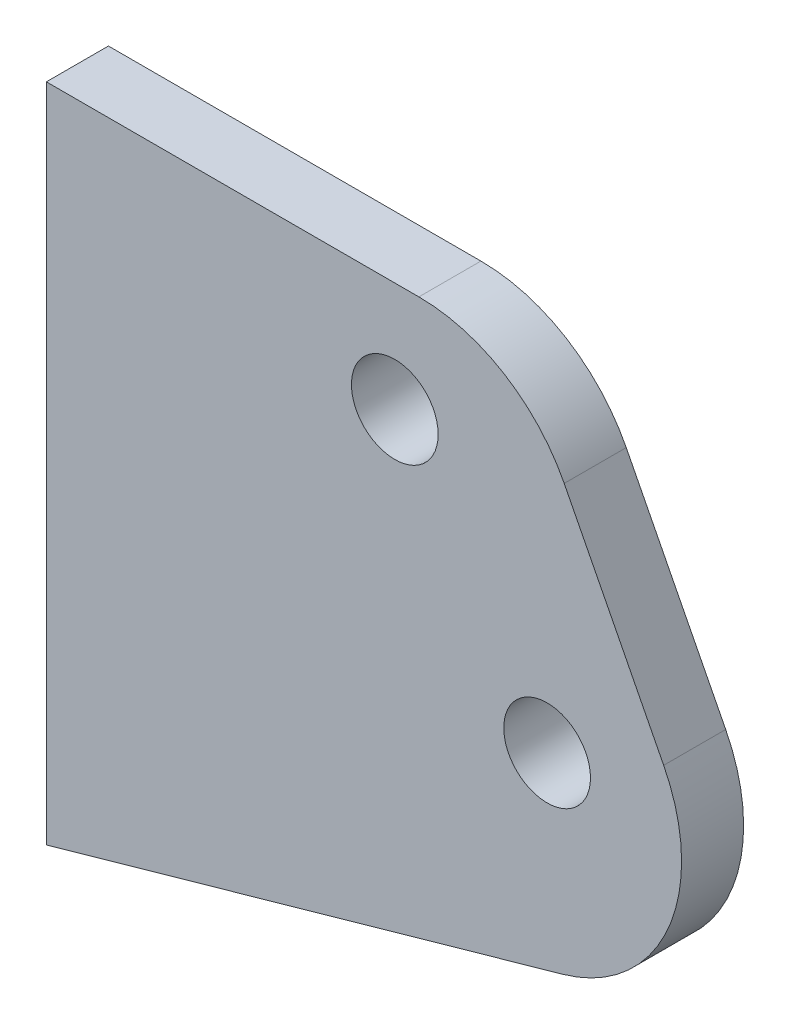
ISO-10303-21;
HEADER;
FILE_DESCRIPTION(('STEP AP214'),'2;1');
FILE_NAME('part.step','',(''),(''),'','','');
FILE_SCHEMA(('AUTOMOTIVE_DESIGN { 1 0 10303 214 1 1 1 1 }'));
ENDSEC;
DATA;
#1=APPLICATION_CONTEXT('core data for automotive mechanical design processes');
#2=APPLICATION_PROTOCOL_DEFINITION('international standard','automotive_design',2000,#1);
#3=PRODUCT_CONTEXT('',#1,'mechanical');
#4=PRODUCT('Part','Part','',(#3));
#5=PRODUCT_RELATED_PRODUCT_CATEGORY('part','',(#4));
#6=PRODUCT_DEFINITION_FORMATION('','',#4);
#7=PRODUCT_DEFINITION_CONTEXT('part definition',#1,'design');
#8=PRODUCT_DEFINITION('design','',#6,#7);
#9=PRODUCT_DEFINITION_SHAPE('','',#8);
#10=(LENGTH_UNIT() NAMED_UNIT(*) SI_UNIT(.MILLI.,.METRE.));
#11=(NAMED_UNIT(*) PLANE_ANGLE_UNIT() SI_UNIT($,.RADIAN.));
#12=(NAMED_UNIT(*) SI_UNIT($,.STERADIAN.) SOLID_ANGLE_UNIT());
#13=UNCERTAINTY_MEASURE_WITH_UNIT(LENGTH_MEASURE(1.E-05),#10,'distance_accuracy_value','');
#14=(GEOMETRIC_REPRESENTATION_CONTEXT(3) GLOBAL_UNCERTAINTY_ASSIGNED_CONTEXT((#13)) GLOBAL_UNIT_ASSIGNED_CONTEXT((#10,
#11,#12)) REPRESENTATION_CONTEXT('',''));
#15=CARTESIAN_POINT('',(0.,0.,0.));
#16=DIRECTION('',(0.,0.,1.));
#17=DIRECTION('',(1.,0.,0.));
#18=AXIS2_PLACEMENT_3D('',#15,#16,#17);
#19=CARTESIAN_POINT('',(55.0792681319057,15.5923536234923,4.826));
#20=DIRECTION('',(-0.272385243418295,0.96218827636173,0.));
#21=DIRECTION('',(-0.96218827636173,-0.272385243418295,0.));
#22=AXIS2_PLACEMENT_3D('',#19,#20,#21);
#23=PLANE('',#22);
#24=DIRECTION('',(0.96218827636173,0.272385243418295,0.));
#25=VECTOR('',#24,1.);
#26=CARTESIAN_POINT('',(55.0792681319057,15.5923536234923,0.));
#27=LINE('',#26,#25);
#28=CARTESIAN_POINT('',(0.,0.,0.));
#29=VERTEX_POINT('',#28);
#30=CARTESIAN_POINT('',(40.1785251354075,11.3741121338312,0.));
#31=VERTEX_POINT('',#30);
#32=EDGE_CURVE('E113',#29,#31,#27,.T.);
#33=ORIENTED_EDGE('',*,*,#32,.T.);
#34=DIRECTION('',(0.,0.,-1.));
#35=VECTOR('',#34,1.);
#36=CARTESIAN_POINT('',(40.1785251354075,11.3741121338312,4.826));
#37=LINE('',#36,#35);
#38=CARTESIAN_POINT('',(40.1785251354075,11.3741121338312,4.826));
#39=VERTEX_POINT('',#38);
#40=EDGE_CURVE('E57',#31,#39,#37,.F.);
#41=ORIENTED_EDGE('',*,*,#40,.T.);
#42=DIRECTION('',(0.96218827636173,0.272385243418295,0.));
#43=VECTOR('',#42,1.);
#44=CARTESIAN_POINT('',(55.0792681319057,15.5923536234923,4.826));
#45=LINE('',#44,#43);
#46=CARTESIAN_POINT('',(0.,0.,4.826));
#47=VERTEX_POINT('',#46);
#48=EDGE_CURVE('E121',#47,#39,#45,.T.);
#49=ORIENTED_EDGE('',*,*,#48,.F.);
#50=DIRECTION('',(0.,0.,-1.));
#51=VECTOR('',#50,1.);
#52=CARTESIAN_POINT('',(0.,0.,4.826));
#53=LINE('',#52,#51);
#54=EDGE_CURVE('E105',#47,#29,#53,.T.);
#55=ORIENTED_EDGE('',*,*,#54,.T.);
#56=EDGE_LOOP('',(#33,#41,#49,#55));
#57=FACE_BOUND('',#56,.T.);
#58=ADVANCED_FACE('F34',(#57),#23,.F.);
#59=CARTESIAN_POINT('',(36.7484746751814,51.4180085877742,4.826));
#60=DIRECTION('',(-0.890234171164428,-0.455503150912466,0.));
#61=DIRECTION('',(0.455503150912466,-0.890234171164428,0.));
#62=AXIS2_PLACEMENT_3D('',#59,#60,#61);
#63=PLANE('',#62);
#64=DIRECTION('',(-0.455503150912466,0.890234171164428,0.));
#65=VECTOR('',#64,1.);
#66=CARTESIAN_POINT('',(36.7484746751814,51.4180085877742,4.826));
#67=LINE('',#66,#65);
#68=CARTESIAN_POINT('',(48.0252065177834,29.3787932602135,4.826));
#69=VERTEX_POINT('',#68);
#70=CARTESIAN_POINT('',(40.2867059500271,44.5028986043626,4.826));
#71=VERTEX_POINT('',#70);
#72=EDGE_CURVE('E95',#69,#71,#67,.T.);
#73=ORIENTED_EDGE('',*,*,#72,.F.);
#74=DIRECTION('',(0.,0.,-1.));
#75=VECTOR('',#74,1.);
#76=CARTESIAN_POINT('',(48.0252065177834,29.3787932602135,4.826));
#77=LINE('',#76,#75);
#78=CARTESIAN_POINT('',(48.0252065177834,29.3787932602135,0.));
#79=VERTEX_POINT('',#78);
#80=EDGE_CURVE('E124',#69,#79,#77,.T.);
#81=ORIENTED_EDGE('',*,*,#80,.T.);
#82=DIRECTION('',(-0.455503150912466,0.890234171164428,0.));
#83=VECTOR('',#82,1.);
#84=CARTESIAN_POINT('',(36.7484746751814,51.4180085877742,0.));
#85=LINE('',#84,#83);
#86=CARTESIAN_POINT('',(40.2867059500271,44.5028986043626,0.));
#87=VERTEX_POINT('',#86);
#88=EDGE_CURVE('E115',#79,#87,#85,.T.);
#89=ORIENTED_EDGE('',*,*,#88,.T.);
#90=DIRECTION('',(0.,0.,-1.));
#91=VECTOR('',#90,1.);
#92=CARTESIAN_POINT('',(40.2867059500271,44.5028986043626,4.826));
#93=LINE('',#92,#91);
#94=EDGE_CURVE('E104',#87,#71,#93,.F.);
#95=ORIENTED_EDGE('',*,*,#94,.T.);
#96=EDGE_LOOP('',(#73,#81,#89,#95));
#97=FACE_BOUND('',#96,.T.);
#98=ADVANCED_FACE('F137',(#97),#63,.F.);
#99=CARTESIAN_POINT('',(0.,51.4180085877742,4.826));
#100=DIRECTION('',(0.,-1.,0.));
#101=DIRECTION('',(0.,0.,-1.));
#102=AXIS2_PLACEMENT_3D('',#99,#100,#101);
#103=PLANE('',#102);
#104=DIRECTION('',(-1.,0.,0.));
#105=VECTOR('',#104,1.);
#106=CARTESIAN_POINT('',(0.,51.4180085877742,4.826));
#107=LINE('',#106,#105);
#108=CARTESIAN_POINT('',(28.9807319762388,51.4180085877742,4.826));
#109=VERTEX_POINT('',#108);
#110=CARTESIAN_POINT('',(0.,51.4180085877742,4.826));
#111=VERTEX_POINT('',#110);
#112=EDGE_CURVE('E87',#109,#111,#107,.T.);
#113=ORIENTED_EDGE('',*,*,#112,.F.);
#114=DIRECTION('',(0.,0.,-1.));
#115=VECTOR('',#114,1.);
#116=CARTESIAN_POINT('',(28.9807319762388,51.4180085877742,4.826));
#117=LINE('',#116,#115);
#118=CARTESIAN_POINT('',(28.9807319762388,51.4180085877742,0.));
#119=VERTEX_POINT('',#118);
#120=EDGE_CURVE('E11',#109,#119,#117,.T.);
#121=ORIENTED_EDGE('',*,*,#120,.T.);
#122=DIRECTION('',(-1.,0.,0.));
#123=VECTOR('',#122,1.);
#124=CARTESIAN_POINT('',(0.,51.4180085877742,0.));
#125=LINE('',#124,#123);
#126=CARTESIAN_POINT('',(0.,51.4180085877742,0.));
#127=VERTEX_POINT('',#126);
#128=EDGE_CURVE('E101',#119,#127,#125,.T.);
#129=ORIENTED_EDGE('',*,*,#128,.T.);
#130=DIRECTION('',(0.,0.,-1.));
#131=VECTOR('',#130,1.);
#132=CARTESIAN_POINT('',(0.,51.4180085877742,4.826));
#133=LINE('',#132,#131);
#134=EDGE_CURVE('E98',#111,#127,#133,.T.);
#135=ORIENTED_EDGE('',*,*,#134,.F.);
#136=EDGE_LOOP('',(#113,#121,#129,#135));
#137=FACE_BOUND('',#136,.T.);
#138=ADVANCED_FACE('F99',(#137),#103,.F.);
#139=CARTESIAN_POINT('',(0.,0.,4.826));
#140=DIRECTION('',(1.,0.,0.));
#141=DIRECTION('',(0.,0.,-1.));
#142=AXIS2_PLACEMENT_3D('',#139,#140,#141);
#143=PLANE('',#142);
#144=DIRECTION('',(0.,-1.,0.));
#145=VECTOR('',#144,1.);
#146=CARTESIAN_POINT('',(0.,0.,0.));
#147=LINE('',#146,#145);
#148=EDGE_CURVE('E120',#127,#29,#147,.T.);
#149=ORIENTED_EDGE('',*,*,#148,.T.);
#150=ORIENTED_EDGE('',*,*,#54,.F.);
#151=DIRECTION('',(0.,-1.,0.));
#152=VECTOR('',#151,1.);
#153=CARTESIAN_POINT('',(0.,0.,4.826));
#154=LINE('',#153,#152);
#155=EDGE_CURVE('E91',#111,#47,#154,.T.);
#156=ORIENTED_EDGE('',*,*,#155,.F.);
#157=ORIENTED_EDGE('',*,*,#134,.T.);
#158=EDGE_LOOP('',(#149,#150,#156,#157));
#159=FACE_BOUND('',#158,.T.);
#160=ADVANCED_FACE('F107',(#159),#143,.F.);
#161=CARTESIAN_POINT('',(55.0792681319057,15.5923536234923,4.826));
#162=DIRECTION('',(0.,0.,1.));
#163=DIRECTION('',(1.,0.,0.));
#164=AXIS2_PLACEMENT_3D('',#161,#162,#163);
#165=PLANE('',#164);
#166=CARTESIAN_POINT('',(38.9577233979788,25.6832464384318,4.826));
#167=DIRECTION('',(0.,0.,1.));
#168=DIRECTION('',(1.,0.,0.));
#169=AXIS2_PLACEMENT_3D('',#166,#167,#168);
#170=CIRCLE('',#169,3.37312);
#171=CARTESIAN_POINT('',(42.3308433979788,25.6832464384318,4.826));
#172=VERTEX_POINT('',#171);
#173=EDGE_CURVE('E152',#172,#172,#170,.T.);
#174=ORIENTED_EDGE('',*,*,#173,.F.);
#175=EDGE_LOOP('',(#174));
#176=FACE_BOUND('',#175,.T.);
#177=CARTESIAN_POINT('',(27.10623356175,42.8977009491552,4.826));
#178=DIRECTION('',(0.,0.,1.));
#179=DIRECTION('',(1.,0.,0.));
#180=AXIS2_PLACEMENT_3D('',#177,#178,#179);
#181=CIRCLE('',#180,3.37312);
#182=CARTESIAN_POINT('',(30.47935356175,42.8977009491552,4.826));
#183=VERTEX_POINT('',#182);
#184=EDGE_CURVE('E146',#183,#183,#181,.T.);
#185=ORIENTED_EDGE('',*,*,#184,.F.);
#186=EDGE_LOOP('',(#185));
#187=FACE_BOUND('',#186,.T.);
#188=ORIENTED_EDGE('',*,*,#48,.T.);
#189=CARTESIAN_POINT('',(36.7192325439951,23.5939032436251,4.826));
#190=DIRECTION('',(0.,0.,1.));
#191=DIRECTION('',(1.,0.,0.));
#192=AXIS2_PLACEMENT_3D('',#189,#190,#191);
#193=CIRCLE('',#192,12.7);
#194=EDGE_CURVE('E42',#39,#69,#193,.T.);
#195=ORIENTED_EDGE('',*,*,#194,.T.);
#196=ORIENTED_EDGE('',*,*,#72,.T.);
#197=CARTESIAN_POINT('',(28.9807319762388,38.7180085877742,4.826));
#198=DIRECTION('',(0.,0.,1.));
#199=DIRECTION('',(1.,0.,0.));
#200=AXIS2_PLACEMENT_3D('',#197,#198,#199);
#201=CIRCLE('',#200,12.7);
#202=EDGE_CURVE('E49',#71,#109,#201,.T.);
#203=ORIENTED_EDGE('',*,*,#202,.T.);
#204=ORIENTED_EDGE('',*,*,#112,.T.);
#205=ORIENTED_EDGE('',*,*,#155,.T.);
#206=EDGE_LOOP('',(#188,#195,#196,#203,#204,#205));
#207=FACE_BOUND('',#206,.T.);
#208=ADVANCED_FACE('F89',(#176,#187,#207),#165,.T.);
#209=CARTESIAN_POINT('',(55.0792681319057,15.5923536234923,0.));
#210=DIRECTION('',(0.,0.,1.));
#211=DIRECTION('',(1.,0.,0.));
#212=AXIS2_PLACEMENT_3D('',#209,#210,#211);
#213=PLANE('',#212);
#214=CARTESIAN_POINT('',(38.9577233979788,25.6832464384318,0.));
#215=DIRECTION('',(0.,0.,1.));
#216=DIRECTION('',(1.,0.,0.));
#217=AXIS2_PLACEMENT_3D('',#214,#215,#216);
#218=CIRCLE('',#217,3.37312);
#219=CARTESIAN_POINT('',(42.3308433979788,25.6832464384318,0.));
#220=VERTEX_POINT('',#219);
#221=EDGE_CURVE('E149',#220,#220,#218,.T.);
#222=ORIENTED_EDGE('',*,*,#221,.T.);
#223=EDGE_LOOP('',(#222));
#224=FACE_BOUND('',#223,.T.);
#225=CARTESIAN_POINT('',(27.10623356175,42.8977009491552,0.));
#226=DIRECTION('',(0.,0.,1.));
#227=DIRECTION('',(1.,0.,0.));
#228=AXIS2_PLACEMENT_3D('',#225,#226,#227);
#229=CIRCLE('',#228,3.37312);
#230=CARTESIAN_POINT('',(30.47935356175,42.8977009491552,0.));
#231=VERTEX_POINT('',#230);
#232=EDGE_CURVE('E116',#231,#231,#229,.T.);
#233=ORIENTED_EDGE('',*,*,#232,.T.);
#234=EDGE_LOOP('',(#233));
#235=FACE_BOUND('',#234,.T.);
#236=ORIENTED_EDGE('',*,*,#88,.F.);
#237=CARTESIAN_POINT('',(36.7192325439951,23.5939032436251,0.));
#238=DIRECTION('',(0.,0.,1.));
#239=DIRECTION('',(1.,0.,0.));
#240=AXIS2_PLACEMENT_3D('',#237,#238,#239);
#241=CIRCLE('',#240,12.7);
#242=EDGE_CURVE('E129',#79,#31,#241,.F.);
#243=ORIENTED_EDGE('',*,*,#242,.T.);
#244=ORIENTED_EDGE('',*,*,#32,.F.);
#245=ORIENTED_EDGE('',*,*,#148,.F.);
#246=ORIENTED_EDGE('',*,*,#128,.F.);
#247=CARTESIAN_POINT('',(28.9807319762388,38.7180085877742,0.));
#248=DIRECTION('',(0.,0.,1.));
#249=DIRECTION('',(1.,0.,0.));
#250=AXIS2_PLACEMENT_3D('',#247,#248,#249);
#251=CIRCLE('',#250,12.7);
#252=EDGE_CURVE('E127',#119,#87,#251,.F.);
#253=ORIENTED_EDGE('',*,*,#252,.T.);
#254=EDGE_LOOP('',(#236,#243,#244,#245,#246,#253));
#255=FACE_BOUND('',#254,.T.);
#256=ADVANCED_FACE('F143',(#224,#235,#255),#213,.F.);
#257=CARTESIAN_POINT('',(27.10623356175,42.8977009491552,0.));
#258=DIRECTION('',(0.,0.,1.));
#259=DIRECTION('',(1.,0.,0.));
#260=AXIS2_PLACEMENT_3D('',#257,#258,#259);
#261=CYLINDRICAL_SURFACE('',#260,3.37312);
#262=ORIENTED_EDGE('',*,*,#232,.F.);
#263=EDGE_LOOP('',(#262));
#264=FACE_BOUND('',#263,.T.);
#265=ORIENTED_EDGE('',*,*,#184,.T.);
#266=EDGE_LOOP('',(#265));
#267=FACE_BOUND('',#266,.T.);
#268=ADVANCED_FACE('F163',(#264,#267),#261,.F.);
#269=CARTESIAN_POINT('',(38.9577233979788,25.6832464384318,0.));
#270=DIRECTION('',(0.,0.,1.));
#271=DIRECTION('',(1.,0.,0.));
#272=AXIS2_PLACEMENT_3D('',#269,#270,#271);
#273=CYLINDRICAL_SURFACE('',#272,3.37312);
#274=ORIENTED_EDGE('',*,*,#221,.F.);
#275=EDGE_LOOP('',(#274));
#276=FACE_BOUND('',#275,.T.);
#277=ORIENTED_EDGE('',*,*,#173,.T.);
#278=EDGE_LOOP('',(#277));
#279=FACE_BOUND('',#278,.T.);
#280=ADVANCED_FACE('F160',(#276,#279),#273,.F.);
#281=CARTESIAN_POINT('',(36.7192325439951,23.5939032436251,4.826));
#282=DIRECTION('',(0.,0.,-1.));
#283=DIRECTION('',(-1.,0.,0.));
#284=AXIS2_PLACEMENT_3D('',#281,#282,#283);
#285=CYLINDRICAL_SURFACE('',#284,12.7);
#286=ORIENTED_EDGE('',*,*,#194,.F.);
#287=ORIENTED_EDGE('',*,*,#40,.F.);
#288=ORIENTED_EDGE('',*,*,#242,.F.);
#289=ORIENTED_EDGE('',*,*,#80,.F.);
#290=EDGE_LOOP('',(#286,#287,#288,#289));
#291=FACE_BOUND('',#290,.T.);
#292=ADVANCED_FACE('F140',(#291),#285,.T.);
#293=CARTESIAN_POINT('',(28.9807319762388,38.7180085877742,4.826));
#294=DIRECTION('',(0.,0.,-1.));
#295=DIRECTION('',(-1.,0.,0.));
#296=AXIS2_PLACEMENT_3D('',#293,#294,#295);
#297=CYLINDRICAL_SURFACE('',#296,12.7);
#298=ORIENTED_EDGE('',*,*,#202,.F.);
#299=ORIENTED_EDGE('',*,*,#94,.F.);
#300=ORIENTED_EDGE('',*,*,#252,.F.);
#301=ORIENTED_EDGE('',*,*,#120,.F.);
#302=EDGE_LOOP('',(#298,#299,#300,#301));
#303=FACE_BOUND('',#302,.T.);
#304=ADVANCED_FACE('F36',(#303),#297,.T.);
#305=CLOSED_SHELL('',(#58,#98,#138,#160,#208,#256,#268,#280,#292,#304));
#306=MANIFOLD_SOLID_BREP('B2',#305);
#307=ADVANCED_BREP_SHAPE_REPRESENTATION('',(#18,#306),#14);
#308=SHAPE_DEFINITION_REPRESENTATION(#9,#307);
ENDSEC;
END-ISO-10303-21;
